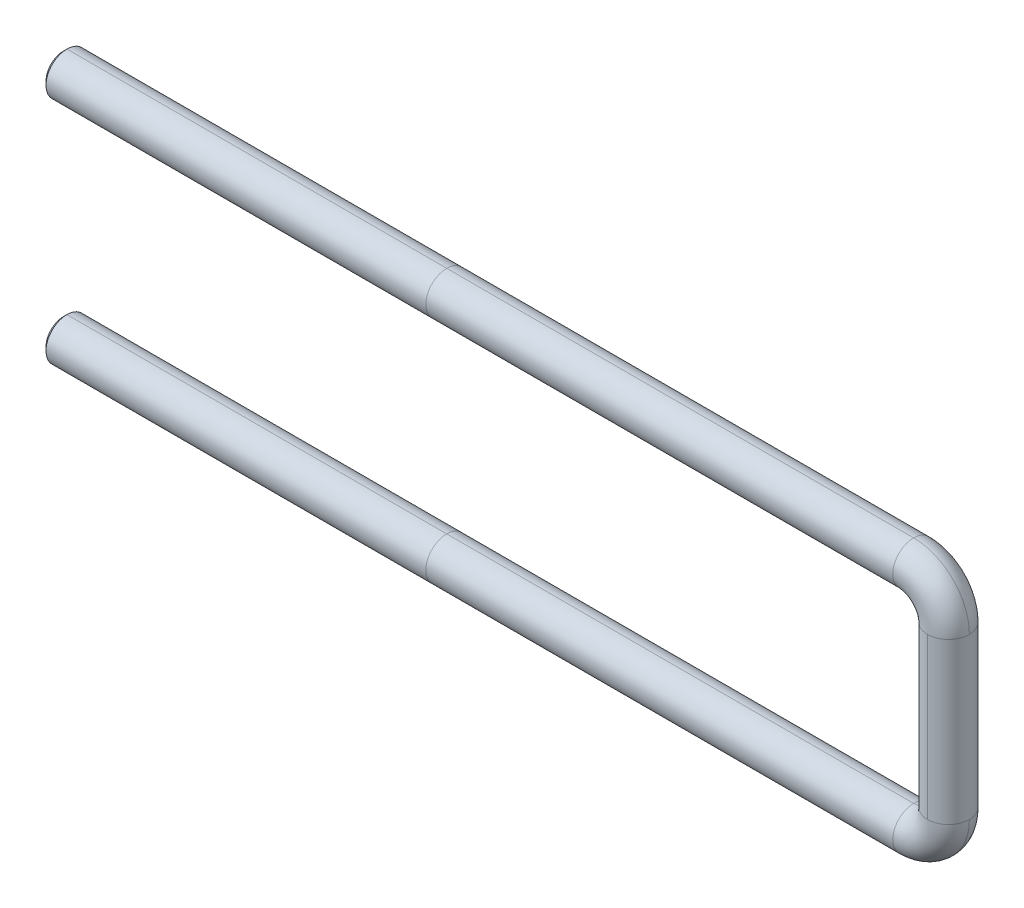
ISO-10303-21;
HEADER;
FILE_DESCRIPTION(('STEP AP214'),'2;1');
FILE_NAME('part.step','',(''),(''),'','','');
FILE_SCHEMA(('AUTOMOTIVE_DESIGN { 1 0 10303 214 1 1 1 1 }'));
ENDSEC;
DATA;
#1=APPLICATION_CONTEXT('core data for automotive mechanical design processes');
#2=APPLICATION_PROTOCOL_DEFINITION('international standard','automotive_design',2000,#1);
#3=PRODUCT_CONTEXT('',#1,'mechanical');
#4=PRODUCT('Part','Part','',(#3));
#5=PRODUCT_RELATED_PRODUCT_CATEGORY('part','',(#4));
#6=PRODUCT_DEFINITION_FORMATION('','',#4);
#7=PRODUCT_DEFINITION_CONTEXT('part definition',#1,'design');
#8=PRODUCT_DEFINITION('design','',#6,#7);
#9=PRODUCT_DEFINITION_SHAPE('','',#8);
#10=(LENGTH_UNIT() NAMED_UNIT(*) SI_UNIT(.MILLI.,.METRE.));
#11=(NAMED_UNIT(*) PLANE_ANGLE_UNIT() SI_UNIT($,.RADIAN.));
#12=(NAMED_UNIT(*) SI_UNIT($,.STERADIAN.) SOLID_ANGLE_UNIT());
#13=UNCERTAINTY_MEASURE_WITH_UNIT(LENGTH_MEASURE(1.E-05),#10,'distance_accuracy_value','');
#14=(GEOMETRIC_REPRESENTATION_CONTEXT(3) GLOBAL_UNCERTAINTY_ASSIGNED_CONTEXT((#13)) GLOBAL_UNIT_ASSIGNED_CONTEXT((#10,
#11,#12)) REPRESENTATION_CONTEXT('',''));
#15=CARTESIAN_POINT('',(0.,0.,0.));
#16=DIRECTION('',(0.,0.,1.));
#17=DIRECTION('',(1.,0.,0.));
#18=AXIS2_PLACEMENT_3D('',#15,#16,#17);
#19=CARTESIAN_POINT('',(-5.,11.5,0.));
#20=DIRECTION('',(0.,0.,-1.));
#21=DIRECTION('',(0.,1.,0.));
#22=AXIS2_PLACEMENT_3D('',#19,#20,#21);
#23=TOROIDAL_SURFACE('',#22,5.,3.);
#24=CARTESIAN_POINT('',(-5.,16.5,0.));
#25=DIRECTION('',(-1.,0.,0.));
#26=DIRECTION('',(0.,1.,0.));
#27=AXIS2_PLACEMENT_3D('',#24,#25,#26);
#28=CIRCLE('',#27,3.);
#29=CARTESIAN_POINT('',(-5.,19.5,0.));
#30=VERTEX_POINT('',#29);
#31=CARTESIAN_POINT('',(-5.,13.5,0.));
#32=VERTEX_POINT('',#31);
#33=EDGE_CURVE('E245',#30,#32,#28,.T.);
#34=ORIENTED_EDGE('',*,*,#33,.F.);
#35=CARTESIAN_POINT('',(-5.,11.5,0.));
#36=DIRECTION('',(0.,0.,-1.));
#37=DIRECTION('',(0.,1.,0.));
#38=AXIS2_PLACEMENT_3D('',#35,#36,#37);
#39=CIRCLE('',#38,8.);
#40=CARTESIAN_POINT('',(3.,11.5,0.));
#41=VERTEX_POINT('',#40);
#42=EDGE_CURVE('E9',#30,#41,#39,.T.);
#43=ORIENTED_EDGE('',*,*,#42,.T.);
#44=CARTESIAN_POINT('',(0.,11.5,0.));
#45=DIRECTION('',(0.,1.,0.));
#46=DIRECTION('',(1.,0.,0.));
#47=AXIS2_PLACEMENT_3D('',#44,#45,#46);
#48=CIRCLE('',#47,3.);
#49=CARTESIAN_POINT('',(0.,11.5,-3.00000000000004));
#50=VERTEX_POINT('',#49);
#51=EDGE_CURVE('E25',#41,#50,#48,.T.);
#52=ORIENTED_EDGE('',*,*,#51,.T.);
#53=CARTESIAN_POINT('',(0.,11.5,0.));
#54=DIRECTION('',(0.,1.,0.));
#55=DIRECTION('',(1.,0.,0.));
#56=AXIS2_PLACEMENT_3D('',#53,#54,#55);
#57=CIRCLE('',#56,3.);
#58=CARTESIAN_POINT('',(-3.,11.5,0.));
#59=VERTEX_POINT('',#58);
#60=EDGE_CURVE('E208',#50,#59,#57,.T.);
#61=ORIENTED_EDGE('',*,*,#60,.T.);
#62=CARTESIAN_POINT('',(-5.,11.5,0.));
#63=DIRECTION('',(0.,0.,-1.));
#64=DIRECTION('',(0.,1.,0.));
#65=AXIS2_PLACEMENT_3D('',#62,#63,#64);
#66=CIRCLE('',#65,2.);
#67=EDGE_CURVE('E197',#32,#59,#66,.T.);
#68=ORIENTED_EDGE('',*,*,#67,.F.);
#69=EDGE_LOOP('',(#34,#43,#52,#61,#68));
#70=FACE_BOUND('',#69,.T.);
#71=ADVANCED_FACE('F14',(#70),#23,.T.);
#72=CARTESIAN_POINT('',(-5.,-11.5,0.));
#73=DIRECTION('',(0.,0.,-1.));
#74=DIRECTION('',(0.,1.,0.));
#75=AXIS2_PLACEMENT_3D('',#72,#73,#74);
#76=TOROIDAL_SURFACE('',#75,5.,3.);
#77=CARTESIAN_POINT('',(0.,-11.5,0.));
#78=DIRECTION('',(0.,1.,0.));
#79=DIRECTION('',(1.,0.,0.));
#80=AXIS2_PLACEMENT_3D('',#77,#78,#79);
#81=CIRCLE('',#80,3.);
#82=CARTESIAN_POINT('',(3.,-11.5,0.));
#83=VERTEX_POINT('',#82);
#84=CARTESIAN_POINT('',(0.,-11.5,-3.00000000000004));
#85=VERTEX_POINT('',#84);
#86=EDGE_CURVE('E220',#83,#85,#81,.T.);
#87=ORIENTED_EDGE('',*,*,#86,.F.);
#88=CARTESIAN_POINT('',(-5.,-11.5,0.));
#89=DIRECTION('',(0.,0.,-1.));
#90=DIRECTION('',(0.,1.,0.));
#91=AXIS2_PLACEMENT_3D('',#88,#89,#90);
#92=CIRCLE('',#91,8.);
#93=CARTESIAN_POINT('',(-5.,-19.5,0.));
#94=VERTEX_POINT('',#93);
#95=EDGE_CURVE('E204',#83,#94,#92,.T.);
#96=ORIENTED_EDGE('',*,*,#95,.T.);
#97=CARTESIAN_POINT('',(-5.,-16.5,0.));
#98=DIRECTION('',(1.,0.,0.));
#99=DIRECTION('',(0.,-1.,0.));
#100=AXIS2_PLACEMENT_3D('',#97,#98,#99);
#101=CIRCLE('',#100,3.);
#102=CARTESIAN_POINT('',(-5.,-13.5,0.));
#103=VERTEX_POINT('',#102);
#104=EDGE_CURVE('E209',#94,#103,#101,.T.);
#105=ORIENTED_EDGE('',*,*,#104,.T.);
#106=CARTESIAN_POINT('',(-5.,-11.5,0.));
#107=DIRECTION('',(0.,0.,-1.));
#108=DIRECTION('',(0.,1.,0.));
#109=AXIS2_PLACEMENT_3D('',#106,#107,#108);
#110=CIRCLE('',#109,2.);
#111=CARTESIAN_POINT('',(-3.,-11.5,0.));
#112=VERTEX_POINT('',#111);
#113=EDGE_CURVE('E187',#112,#103,#110,.T.);
#114=ORIENTED_EDGE('',*,*,#113,.F.);
#115=CARTESIAN_POINT('',(0.,-11.5,0.));
#116=DIRECTION('',(0.,1.,0.));
#117=DIRECTION('',(1.,0.,0.));
#118=AXIS2_PLACEMENT_3D('',#115,#116,#117);
#119=CIRCLE('',#118,3.);
#120=EDGE_CURVE('E188',#85,#112,#119,.T.);
#121=ORIENTED_EDGE('',*,*,#120,.F.);
#122=EDGE_LOOP('',(#87,#96,#105,#114,#121));
#123=FACE_BOUND('',#122,.T.);
#124=ADVANCED_FACE('F331',(#123),#76,.T.);
#125=CARTESIAN_POINT('',(-126.5,-16.5,0.));
#126=DIRECTION('',(1.,0.,0.));
#127=DIRECTION('',(0.,0.,-1.));
#128=AXIS2_PLACEMENT_3D('',#125,#126,#127);
#129=CONICAL_SURFACE('',#128,3.,0.785398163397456);
#130=CARTESIAN_POINT('',(-127.,-16.5,0.));
#131=DIRECTION('',(-1.,0.,0.));
#132=DIRECTION('',(0.,-1.,0.));
#133=AXIS2_PLACEMENT_3D('',#130,#131,#132);
#134=CIRCLE('',#133,2.49999999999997);
#135=CARTESIAN_POINT('',(-127.,-16.5,2.49999999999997));
#136=VERTEX_POINT('',#135);
#137=CARTESIAN_POINT('',(-127.,-16.5,-2.5));
#138=VERTEX_POINT('',#137);
#139=EDGE_CURVE('E214',#136,#138,#134,.T.);
#140=ORIENTED_EDGE('',*,*,#139,.F.);
#141=DIRECTION('',(0.707106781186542,0.,0.707106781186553));
#142=VECTOR('',#141,1.);
#143=CARTESIAN_POINT('',(-126.5,-16.5,3.));
#144=LINE('',#143,#142);
#145=CARTESIAN_POINT('',(-126.5,-16.5,3.));
#146=VERTEX_POINT('',#145);
#147=EDGE_CURVE('E244',#136,#146,#144,.T.);
#148=ORIENTED_EDGE('',*,*,#147,.T.);
#149=CARTESIAN_POINT('',(-126.5,-16.5,0.));
#150=DIRECTION('',(1.,0.,0.));
#151=DIRECTION('',(0.,0.,-1.));
#152=AXIS2_PLACEMENT_3D('',#149,#150,#151);
#153=CIRCLE('',#152,3.);
#154=CARTESIAN_POINT('',(-126.5,-13.5,0.));
#155=VERTEX_POINT('',#154);
#156=EDGE_CURVE('E255',#155,#146,#153,.T.);
#157=ORIENTED_EDGE('',*,*,#156,.F.);
#158=CARTESIAN_POINT('',(-126.5,-16.5,0.));
#159=DIRECTION('',(1.,0.,0.));
#160=DIRECTION('',(0.,0.,-1.));
#161=AXIS2_PLACEMENT_3D('',#158,#159,#160);
#162=CIRCLE('',#161,3.);
#163=CARTESIAN_POINT('',(-126.5,-16.5,-3.));
#164=VERTEX_POINT('',#163);
#165=EDGE_CURVE('E265',#164,#155,#162,.T.);
#166=ORIENTED_EDGE('',*,*,#165,.F.);
#167=DIRECTION('',(0.707106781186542,0.,-0.707106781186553));
#168=VECTOR('',#167,1.);
#169=CARTESIAN_POINT('',(-126.5,-16.5,-3.));
#170=LINE('',#169,#168);
#171=EDGE_CURVE('E306',#138,#164,#170,.T.);
#172=ORIENTED_EDGE('',*,*,#171,.F.);
#173=EDGE_LOOP('',(#140,#148,#157,#166,#172));
#174=FACE_BOUND('',#173,.T.);
#175=ADVANCED_FACE('F337',(#174),#129,.T.);
#176=CARTESIAN_POINT('',(-127.,16.5,0.));
#177=DIRECTION('',(1.,0.,0.));
#178=DIRECTION('',(0.,0.,-1.));
#179=AXIS2_PLACEMENT_3D('',#176,#177,#178);
#180=CONICAL_SURFACE('',#179,2.49999999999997,0.785398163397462);
#181=CARTESIAN_POINT('',(-127.,16.5,0.));
#182=DIRECTION('',(-1.,0.,0.));
#183=DIRECTION('',(0.,1.,0.));
#184=AXIS2_PLACEMENT_3D('',#181,#182,#183);
#185=CIRCLE('',#184,2.49999999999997);
#186=CARTESIAN_POINT('',(-127.,16.5,2.49999999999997));
#187=VERTEX_POINT('',#186);
#188=CARTESIAN_POINT('',(-127.,16.5,-2.5));
#189=VERTEX_POINT('',#188);
#190=EDGE_CURVE('E215',#187,#189,#185,.T.);
#191=ORIENTED_EDGE('',*,*,#190,.F.);
#192=DIRECTION('',(0.707106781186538,0.,0.707106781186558));
#193=VECTOR('',#192,1.);
#194=CARTESIAN_POINT('',(-127.,16.5,2.49999999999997));
#195=LINE('',#194,#193);
#196=CARTESIAN_POINT('',(-126.5,16.5,3.));
#197=VERTEX_POINT('',#196);
#198=EDGE_CURVE('E152',#187,#197,#195,.T.);
#199=ORIENTED_EDGE('',*,*,#198,.T.);
#200=CARTESIAN_POINT('',(-126.5,16.5,0.));
#201=DIRECTION('',(1.,0.,0.));
#202=DIRECTION('',(0.,0.,1.));
#203=AXIS2_PLACEMENT_3D('',#200,#201,#202);
#204=CIRCLE('',#203,3.);
#205=CARTESIAN_POINT('',(-126.5,19.5,0.));
#206=VERTEX_POINT('',#205);
#207=EDGE_CURVE('E146',#206,#197,#204,.T.);
#208=ORIENTED_EDGE('',*,*,#207,.F.);
#209=CARTESIAN_POINT('',(-126.5,16.5,0.));
#210=DIRECTION('',(1.,0.,0.));
#211=DIRECTION('',(0.,0.,1.));
#212=AXIS2_PLACEMENT_3D('',#209,#210,#211);
#213=CIRCLE('',#212,3.);
#214=CARTESIAN_POINT('',(-126.5,16.5,-3.));
#215=VERTEX_POINT('',#214);
#216=EDGE_CURVE('E149',#215,#206,#213,.T.);
#217=ORIENTED_EDGE('',*,*,#216,.F.);
#218=DIRECTION('',(0.707106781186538,0.,-0.707106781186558));
#219=VECTOR('',#218,1.);
#220=CARTESIAN_POINT('',(-127.,16.5,-2.5));
#221=LINE('',#220,#219);
#222=EDGE_CURVE('E241',#189,#215,#221,.T.);
#223=ORIENTED_EDGE('',*,*,#222,.F.);
#224=EDGE_LOOP('',(#191,#199,#208,#217,#223));
#225=FACE_BOUND('',#224,.T.);
#226=ADVANCED_FACE('F148',(#225),#180,.T.);
#227=CARTESIAN_POINT('',(-5.,16.5,0.));
#228=DIRECTION('',(-1.,0.,0.));
#229=DIRECTION('',(0.,1.,0.));
#230=AXIS2_PLACEMENT_3D('',#227,#228,#229);
#231=CYLINDRICAL_SURFACE('',#230,3.);
#232=ORIENTED_EDGE('',*,*,#33,.T.);
#233=DIRECTION('',(-1.,0.,0.));
#234=VECTOR('',#233,1.);
#235=CARTESIAN_POINT('',(-5.,13.5,0.));
#236=LINE('',#235,#234);
#237=CARTESIAN_POINT('',(-72.,13.5,0.));
#238=VERTEX_POINT('',#237);
#239=EDGE_CURVE('E233',#32,#238,#236,.T.);
#240=ORIENTED_EDGE('',*,*,#239,.T.);
#241=CARTESIAN_POINT('',(-72.,16.5,0.));
#242=DIRECTION('',(-1.,0.,0.));
#243=DIRECTION('',(0.,0.,-1.));
#244=AXIS2_PLACEMENT_3D('',#241,#242,#243);
#245=CIRCLE('',#244,3.);
#246=CARTESIAN_POINT('',(-72.,19.5,0.));
#247=VERTEX_POINT('',#246);
#248=EDGE_CURVE('E263',#247,#238,#245,.T.);
#249=ORIENTED_EDGE('',*,*,#248,.F.);
#250=DIRECTION('',(-1.,0.,0.));
#251=VECTOR('',#250,1.);
#252=CARTESIAN_POINT('',(-5.,19.5,0.));
#253=LINE('',#252,#251);
#254=EDGE_CURVE('E40',#30,#247,#253,.T.);
#255=ORIENTED_EDGE('',*,*,#254,.F.);
#256=EDGE_LOOP('',(#232,#240,#249,#255));
#257=FACE_BOUND('',#256,.T.);
#258=ADVANCED_FACE('F347',(#257),#231,.T.);
#259=CARTESIAN_POINT('',(0.,11.5,0.));
#260=DIRECTION('',(0.,-1.,0.));
#261=DIRECTION('',(0.,0.,-1.));
#262=AXIS2_PLACEMENT_3D('',#259,#260,#261);
#263=CYLINDRICAL_SURFACE('',#262,3.);
#264=CARTESIAN_POINT('',(0.,11.5,0.));
#265=DIRECTION('',(0.,1.,0.));
#266=DIRECTION('',(1.,0.,0.));
#267=AXIS2_PLACEMENT_3D('',#264,#265,#266);
#268=CIRCLE('',#267,3.);
#269=CARTESIAN_POINT('',(0.,11.5,3.));
#270=VERTEX_POINT('',#269);
#271=EDGE_CURVE('E198',#270,#41,#268,.T.);
#272=ORIENTED_EDGE('',*,*,#271,.F.);
#273=DIRECTION('',(0.,-1.,0.));
#274=VECTOR('',#273,1.);
#275=CARTESIAN_POINT('',(0.,11.5,3.));
#276=LINE('',#275,#274);
#277=CARTESIAN_POINT('',(0.,-11.5,3.));
#278=VERTEX_POINT('',#277);
#279=EDGE_CURVE('E229',#270,#278,#276,.T.);
#280=ORIENTED_EDGE('',*,*,#279,.T.);
#281=CARTESIAN_POINT('',(0.,-11.5,0.));
#282=DIRECTION('',(0.,1.,0.));
#283=DIRECTION('',(1.,0.,0.));
#284=AXIS2_PLACEMENT_3D('',#281,#282,#283);
#285=CIRCLE('',#284,3.);
#286=EDGE_CURVE('E234',#278,#83,#285,.T.);
#287=ORIENTED_EDGE('',*,*,#286,.T.);
#288=ORIENTED_EDGE('',*,*,#86,.T.);
#289=DIRECTION('',(0.,-1.,0.));
#290=VECTOR('',#289,1.);
#291=CARTESIAN_POINT('',(0.,11.5,-3.00000000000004));
#292=LINE('',#291,#290);
#293=EDGE_CURVE('E192',#50,#85,#292,.T.);
#294=ORIENTED_EDGE('',*,*,#293,.F.);
#295=ORIENTED_EDGE('',*,*,#51,.F.);
#296=EDGE_LOOP('',(#272,#280,#287,#288,#294,#295));
#297=FACE_BOUND('',#296,.T.);
#298=ADVANCED_FACE('F350',(#297),#263,.T.);
#299=CARTESIAN_POINT('',(-5.,-16.5,0.));
#300=DIRECTION('',(-1.,0.,0.));
#301=DIRECTION('',(0.,1.,0.));
#302=AXIS2_PLACEMENT_3D('',#299,#300,#301);
#303=CYLINDRICAL_SURFACE('',#302,3.);
#304=ORIENTED_EDGE('',*,*,#104,.F.);
#305=DIRECTION('',(-1.,0.,0.));
#306=VECTOR('',#305,1.);
#307=CARTESIAN_POINT('',(-5.,-19.5,0.));
#308=LINE('',#307,#306);
#309=CARTESIAN_POINT('',(-72.,-19.5,0.));
#310=VERTEX_POINT('',#309);
#311=EDGE_CURVE('E216',#94,#310,#308,.T.);
#312=ORIENTED_EDGE('',*,*,#311,.T.);
#313=CARTESIAN_POINT('',(-72.,-16.5,0.));
#314=DIRECTION('',(1.,0.,0.));
#315=DIRECTION('',(0.,0.,-1.));
#316=AXIS2_PLACEMENT_3D('',#313,#314,#315);
#317=CIRCLE('',#316,3.);
#318=CARTESIAN_POINT('',(-72.,-13.5,0.));
#319=VERTEX_POINT('',#318);
#320=EDGE_CURVE('E221',#310,#319,#317,.T.);
#321=ORIENTED_EDGE('',*,*,#320,.T.);
#322=DIRECTION('',(-1.,0.,0.));
#323=VECTOR('',#322,1.);
#324=CARTESIAN_POINT('',(-5.,-13.5,0.));
#325=LINE('',#324,#323);
#326=EDGE_CURVE('E186',#103,#319,#325,.T.);
#327=ORIENTED_EDGE('',*,*,#326,.F.);
#328=EDGE_LOOP('',(#304,#312,#321,#327));
#329=FACE_BOUND('',#328,.T.);
#330=ADVANCED_FACE('F379',(#329),#303,.T.);
#331=CARTESIAN_POINT('',(-5.,-16.5,0.));
#332=DIRECTION('',(-1.,0.,0.));
#333=DIRECTION('',(0.,1.,0.));
#334=AXIS2_PLACEMENT_3D('',#331,#332,#333);
#335=CYLINDRICAL_SURFACE('',#334,3.);
#336=ORIENTED_EDGE('',*,*,#320,.F.);
#337=DIRECTION('',(-1.,0.,0.));
#338=VECTOR('',#337,1.);
#339=CARTESIAN_POINT('',(-5.,-19.5,0.));
#340=LINE('',#339,#338);
#341=CARTESIAN_POINT('',(-126.5,-19.5,0.));
#342=VERTEX_POINT('',#341);
#343=EDGE_CURVE('E291',#310,#342,#340,.T.);
#344=ORIENTED_EDGE('',*,*,#343,.T.);
#345=CARTESIAN_POINT('',(-126.5,-16.5,0.));
#346=DIRECTION('',(1.,0.,0.));
#347=DIRECTION('',(0.,0.,-1.));
#348=AXIS2_PLACEMENT_3D('',#345,#346,#347);
#349=CIRCLE('',#348,3.);
#350=EDGE_CURVE('E287',#342,#164,#349,.T.);
#351=ORIENTED_EDGE('',*,*,#350,.T.);
#352=ORIENTED_EDGE('',*,*,#165,.T.);
#353=DIRECTION('',(-1.,0.,0.));
#354=VECTOR('',#353,1.);
#355=CARTESIAN_POINT('',(-5.,-13.5,0.));
#356=LINE('',#355,#354);
#357=EDGE_CURVE('E258',#319,#155,#356,.T.);
#358=ORIENTED_EDGE('',*,*,#357,.F.);
#359=EDGE_LOOP('',(#336,#344,#351,#352,#358));
#360=FACE_BOUND('',#359,.T.);
#361=ADVANCED_FACE('F375',(#360),#335,.T.);
#362=CARTESIAN_POINT('',(-5.,16.5,0.));
#363=DIRECTION('',(-1.,0.,0.));
#364=DIRECTION('',(0.,1.,0.));
#365=AXIS2_PLACEMENT_3D('',#362,#363,#364);
#366=CYLINDRICAL_SURFACE('',#365,3.);
#367=ORIENTED_EDGE('',*,*,#248,.T.);
#368=DIRECTION('',(-1.,0.,0.));
#369=VECTOR('',#368,1.);
#370=CARTESIAN_POINT('',(-5.,13.5,0.));
#371=LINE('',#370,#369);
#372=CARTESIAN_POINT('',(-126.5,13.5,0.));
#373=VERTEX_POINT('',#372);
#374=EDGE_CURVE('E181',#238,#373,#371,.T.);
#375=ORIENTED_EDGE('',*,*,#374,.T.);
#376=CARTESIAN_POINT('',(-126.5,16.5,0.));
#377=DIRECTION('',(1.,0.,0.));
#378=DIRECTION('',(0.,0.,1.));
#379=AXIS2_PLACEMENT_3D('',#376,#377,#378);
#380=CIRCLE('',#379,3.);
#381=EDGE_CURVE('E166',#373,#215,#380,.T.);
#382=ORIENTED_EDGE('',*,*,#381,.T.);
#383=ORIENTED_EDGE('',*,*,#216,.T.);
#384=DIRECTION('',(-1.,0.,0.));
#385=VECTOR('',#384,1.);
#386=CARTESIAN_POINT('',(-5.,19.5,0.));
#387=LINE('',#386,#385);
#388=EDGE_CURVE('E158',#247,#206,#387,.T.);
#389=ORIENTED_EDGE('',*,*,#388,.F.);
#390=EDGE_LOOP('',(#367,#375,#382,#383,#389));
#391=FACE_BOUND('',#390,.T.);
#392=ADVANCED_FACE('F164',(#391),#366,.T.);
#393=CARTESIAN_POINT('',(-5.,16.5,0.));
#394=DIRECTION('',(-1.,0.,0.));
#395=DIRECTION('',(0.,1.,0.));
#396=AXIS2_PLACEMENT_3D('',#393,#394,#395);
#397=CYLINDRICAL_SURFACE('',#396,3.);
#398=ORIENTED_EDGE('',*,*,#374,.F.);
#399=CARTESIAN_POINT('',(-72.,16.5,0.));
#400=DIRECTION('',(-1.,0.,0.));
#401=DIRECTION('',(0.,0.,-1.));
#402=AXIS2_PLACEMENT_3D('',#399,#400,#401);
#403=CIRCLE('',#402,3.);
#404=EDGE_CURVE('E18',#238,#247,#403,.T.);
#405=ORIENTED_EDGE('',*,*,#404,.T.);
#406=ORIENTED_EDGE('',*,*,#388,.T.);
#407=ORIENTED_EDGE('',*,*,#207,.T.);
#408=CARTESIAN_POINT('',(-126.5,16.5,0.));
#409=DIRECTION('',(1.,0.,0.));
#410=DIRECTION('',(0.,0.,1.));
#411=AXIS2_PLACEMENT_3D('',#408,#409,#410);
#412=CIRCLE('',#411,3.);
#413=EDGE_CURVE('E159',#197,#373,#412,.T.);
#414=ORIENTED_EDGE('',*,*,#413,.T.);
#415=EDGE_LOOP('',(#398,#405,#406,#407,#414));
#416=FACE_BOUND('',#415,.T.);
#417=ADVANCED_FACE('F170',(#416),#397,.T.);
#418=CARTESIAN_POINT('',(-5.,-16.5,0.));
#419=DIRECTION('',(-1.,0.,0.));
#420=DIRECTION('',(0.,1.,0.));
#421=AXIS2_PLACEMENT_3D('',#418,#419,#420);
#422=CYLINDRICAL_SURFACE('',#421,3.);
#423=ORIENTED_EDGE('',*,*,#343,.F.);
#424=CARTESIAN_POINT('',(-72.,-16.5,0.));
#425=DIRECTION('',(1.,0.,0.));
#426=DIRECTION('',(0.,0.,-1.));
#427=AXIS2_PLACEMENT_3D('',#424,#425,#426);
#428=CIRCLE('',#427,3.);
#429=EDGE_CURVE('E183',#319,#310,#428,.T.);
#430=ORIENTED_EDGE('',*,*,#429,.F.);
#431=ORIENTED_EDGE('',*,*,#357,.T.);
#432=ORIENTED_EDGE('',*,*,#156,.T.);
#433=CARTESIAN_POINT('',(-126.5,-16.5,0.));
#434=DIRECTION('',(1.,0.,0.));
#435=DIRECTION('',(0.,0.,-1.));
#436=AXIS2_PLACEMENT_3D('',#433,#434,#435);
#437=CIRCLE('',#436,3.);
#438=EDGE_CURVE('E259',#146,#342,#437,.T.);
#439=ORIENTED_EDGE('',*,*,#438,.T.);
#440=EDGE_LOOP('',(#423,#430,#431,#432,#439));
#441=FACE_BOUND('',#440,.T.);
#442=ADVANCED_FACE('F360',(#441),#422,.T.);
#443=CARTESIAN_POINT('',(-5.,-16.5,0.));
#444=DIRECTION('',(-1.,0.,0.));
#445=DIRECTION('',(0.,1.,0.));
#446=AXIS2_PLACEMENT_3D('',#443,#444,#445);
#447=CYLINDRICAL_SURFACE('',#446,3.);
#448=ORIENTED_EDGE('',*,*,#311,.F.);
#449=CARTESIAN_POINT('',(-5.,-16.5,0.));
#450=DIRECTION('',(1.,0.,0.));
#451=DIRECTION('',(0.,-1.,0.));
#452=AXIS2_PLACEMENT_3D('',#449,#450,#451);
#453=CIRCLE('',#452,3.);
#454=EDGE_CURVE('E251',#103,#94,#453,.T.);
#455=ORIENTED_EDGE('',*,*,#454,.F.);
#456=ORIENTED_EDGE('',*,*,#326,.T.);
#457=ORIENTED_EDGE('',*,*,#429,.T.);
#458=EDGE_LOOP('',(#448,#455,#456,#457));
#459=FACE_BOUND('',#458,.T.);
#460=ADVANCED_FACE('F355',(#459),#447,.T.);
#461=CARTESIAN_POINT('',(-5.,-11.5,0.));
#462=DIRECTION('',(0.,0.,-1.));
#463=DIRECTION('',(0.,1.,0.));
#464=AXIS2_PLACEMENT_3D('',#461,#462,#463);
#465=TOROIDAL_SURFACE('',#464,5.,3.);
#466=ORIENTED_EDGE('',*,*,#95,.F.);
#467=ORIENTED_EDGE('',*,*,#286,.F.);
#468=CARTESIAN_POINT('',(0.,-11.5,0.));
#469=DIRECTION('',(0.,1.,0.));
#470=DIRECTION('',(1.,0.,0.));
#471=AXIS2_PLACEMENT_3D('',#468,#469,#470);
#472=CIRCLE('',#471,3.);
#473=EDGE_CURVE('E193',#112,#278,#472,.T.);
#474=ORIENTED_EDGE('',*,*,#473,.F.);
#475=ORIENTED_EDGE('',*,*,#113,.T.);
#476=ORIENTED_EDGE('',*,*,#454,.T.);
#477=EDGE_LOOP('',(#466,#467,#474,#475,#476));
#478=FACE_BOUND('',#477,.T.);
#479=ADVANCED_FACE('F351',(#478),#465,.T.);
#480=CARTESIAN_POINT('',(0.,11.5,0.));
#481=DIRECTION('',(0.,-1.,0.));
#482=DIRECTION('',(0.,0.,-1.));
#483=AXIS2_PLACEMENT_3D('',#480,#481,#482);
#484=CYLINDRICAL_SURFACE('',#483,3.);
#485=ORIENTED_EDGE('',*,*,#279,.F.);
#486=CARTESIAN_POINT('',(0.,11.5,0.));
#487=DIRECTION('',(0.,1.,0.));
#488=DIRECTION('',(1.,0.,0.));
#489=AXIS2_PLACEMENT_3D('',#486,#487,#488);
#490=CIRCLE('',#489,3.);
#491=EDGE_CURVE('E194',#59,#270,#490,.T.);
#492=ORIENTED_EDGE('',*,*,#491,.F.);
#493=ORIENTED_EDGE('',*,*,#60,.F.);
#494=ORIENTED_EDGE('',*,*,#293,.T.);
#495=ORIENTED_EDGE('',*,*,#120,.T.);
#496=ORIENTED_EDGE('',*,*,#473,.T.);
#497=EDGE_LOOP('',(#485,#492,#493,#494,#495,#496));
#498=FACE_BOUND('',#497,.T.);
#499=ADVANCED_FACE('F354',(#498),#484,.T.);
#500=CARTESIAN_POINT('',(-5.,11.5,0.));
#501=DIRECTION('',(0.,0.,-1.));
#502=DIRECTION('',(0.,1.,0.));
#503=AXIS2_PLACEMENT_3D('',#500,#501,#502);
#504=TOROIDAL_SURFACE('',#503,5.,3.);
#505=ORIENTED_EDGE('',*,*,#42,.F.);
#506=CARTESIAN_POINT('',(-5.,16.5,0.));
#507=DIRECTION('',(-1.,0.,0.));
#508=DIRECTION('',(0.,1.,0.));
#509=AXIS2_PLACEMENT_3D('',#506,#507,#508);
#510=CIRCLE('',#509,3.);
#511=EDGE_CURVE('E202',#32,#30,#510,.T.);
#512=ORIENTED_EDGE('',*,*,#511,.F.);
#513=ORIENTED_EDGE('',*,*,#67,.T.);
#514=ORIENTED_EDGE('',*,*,#491,.T.);
#515=ORIENTED_EDGE('',*,*,#271,.T.);
#516=EDGE_LOOP('',(#505,#512,#513,#514,#515));
#517=FACE_BOUND('',#516,.T.);
#518=ADVANCED_FACE('F358',(#517),#504,.T.);
#519=CARTESIAN_POINT('',(-5.,16.5,0.));
#520=DIRECTION('',(-1.,0.,0.));
#521=DIRECTION('',(0.,1.,0.));
#522=AXIS2_PLACEMENT_3D('',#519,#520,#521);
#523=CYLINDRICAL_SURFACE('',#522,3.);
#524=ORIENTED_EDGE('',*,*,#239,.F.);
#525=ORIENTED_EDGE('',*,*,#511,.T.);
#526=ORIENTED_EDGE('',*,*,#254,.T.);
#527=ORIENTED_EDGE('',*,*,#404,.F.);
#528=EDGE_LOOP('',(#524,#525,#526,#527));
#529=FACE_BOUND('',#528,.T.);
#530=ADVANCED_FACE('F16',(#529),#523,.T.);
#531=CARTESIAN_POINT('',(-127.,-16.5,0.));
#532=DIRECTION('',(1.,0.,0.));
#533=DIRECTION('',(0.,1.,0.));
#534=AXIS2_PLACEMENT_3D('',#531,#532,#533);
#535=PLANE('',#534);
#536=CARTESIAN_POINT('',(-127.,-16.5,0.));
#537=DIRECTION('',(-1.,0.,0.));
#538=DIRECTION('',(0.,-1.,0.));
#539=AXIS2_PLACEMENT_3D('',#536,#537,#538);
#540=CIRCLE('',#539,2.49999999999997);
#541=EDGE_CURVE('E203',#138,#136,#540,.T.);
#542=ORIENTED_EDGE('',*,*,#541,.T.);
#543=ORIENTED_EDGE('',*,*,#139,.T.);
#544=EDGE_LOOP('',(#542,#543));
#545=FACE_BOUND('',#544,.T.);
#546=ADVANCED_FACE('F317',(#545),#535,.F.);
#547=CARTESIAN_POINT('',(-127.,16.5,0.));
#548=DIRECTION('',(-1.,0.,0.));
#549=DIRECTION('',(0.,0.,1.));
#550=AXIS2_PLACEMENT_3D('',#547,#548,#549);
#551=PLANE('',#550);
#552=CARTESIAN_POINT('',(-127.,16.5,0.));
#553=DIRECTION('',(-1.,0.,0.));
#554=DIRECTION('',(0.,1.,0.));
#555=AXIS2_PLACEMENT_3D('',#552,#553,#554);
#556=CIRCLE('',#555,2.49999999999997);
#557=EDGE_CURVE('E210',#189,#187,#556,.T.);
#558=ORIENTED_EDGE('',*,*,#557,.T.);
#559=ORIENTED_EDGE('',*,*,#190,.T.);
#560=EDGE_LOOP('',(#558,#559));
#561=FACE_BOUND('',#560,.T.);
#562=ADVANCED_FACE('F315',(#561),#551,.T.);
#563=CARTESIAN_POINT('',(-127.,16.5,0.));
#564=DIRECTION('',(1.,0.,0.));
#565=DIRECTION('',(0.,0.,-1.));
#566=AXIS2_PLACEMENT_3D('',#563,#564,#565);
#567=CONICAL_SURFACE('',#566,2.49999999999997,0.785398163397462);
#568=ORIENTED_EDGE('',*,*,#198,.F.);
#569=ORIENTED_EDGE('',*,*,#557,.F.);
#570=ORIENTED_EDGE('',*,*,#222,.T.);
#571=ORIENTED_EDGE('',*,*,#381,.F.);
#572=ORIENTED_EDGE('',*,*,#413,.F.);
#573=EDGE_LOOP('',(#568,#569,#570,#571,#572));
#574=FACE_BOUND('',#573,.T.);
#575=ADVANCED_FACE('F313',(#574),#567,.T.);
#576=CARTESIAN_POINT('',(-126.5,-16.5,0.));
#577=DIRECTION('',(1.,0.,0.));
#578=DIRECTION('',(0.,0.,-1.));
#579=AXIS2_PLACEMENT_3D('',#576,#577,#578);
#580=CONICAL_SURFACE('',#579,3.,0.785398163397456);
#581=ORIENTED_EDGE('',*,*,#147,.F.);
#582=ORIENTED_EDGE('',*,*,#541,.F.);
#583=ORIENTED_EDGE('',*,*,#171,.T.);
#584=ORIENTED_EDGE('',*,*,#350,.F.);
#585=ORIENTED_EDGE('',*,*,#438,.F.);
#586=EDGE_LOOP('',(#581,#582,#583,#584,#585));
#587=FACE_BOUND('',#586,.T.);
#588=ADVANCED_FACE('F325',(#587),#580,.T.);
#589=CLOSED_SHELL('',(#71,#124,#175,#226,#258,#298,#330,#361,#392,#417,#442,#460,#479,#499,#518,
#530,#546,#562,#575,#588));
#590=MANIFOLD_SOLID_BREP('B1',#589);
#591=ADVANCED_BREP_SHAPE_REPRESENTATION('',(#18,#590),#14);
#592=SHAPE_DEFINITION_REPRESENTATION(#9,#591);
ENDSEC;
END-ISO-10303-21;
